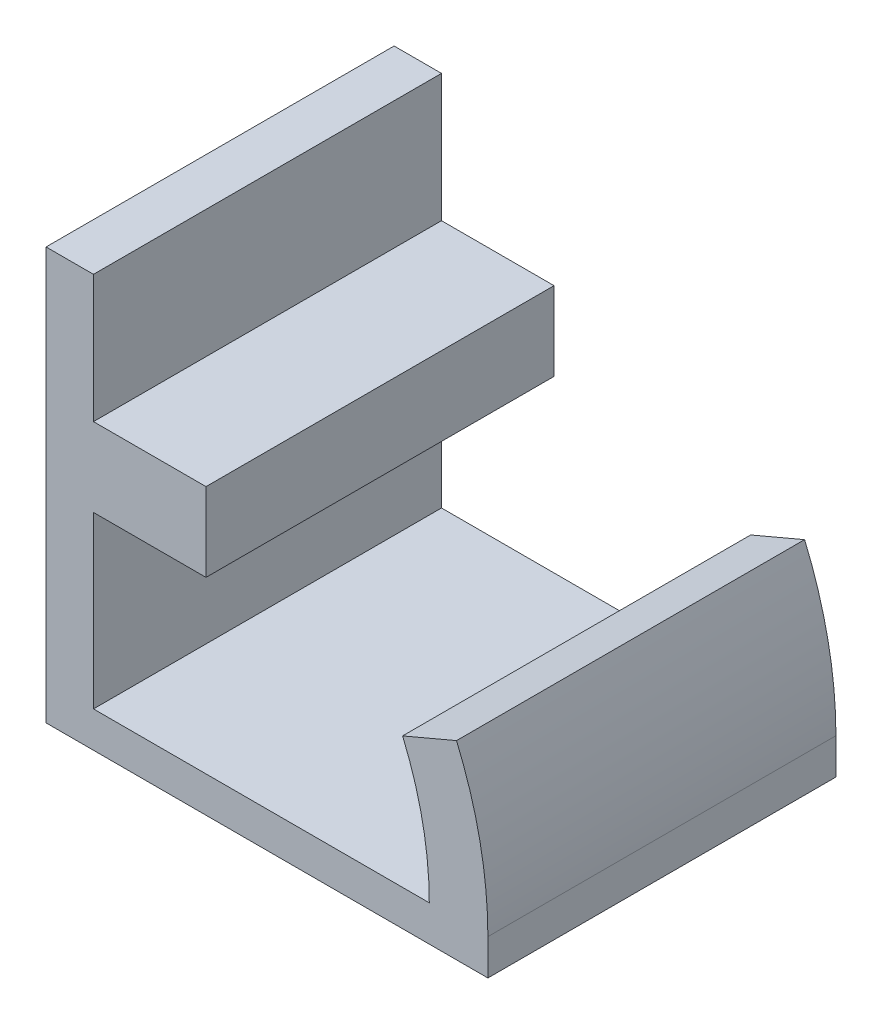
ISO-10303-21;
HEADER;
FILE_DESCRIPTION(('STEP AP214'),'2;1');
FILE_NAME('part.step','',(''),(''),'','','');
FILE_SCHEMA(('AUTOMOTIVE_DESIGN { 1 0 10303 214 1 1 1 1 }'));
ENDSEC;
DATA;
#1=APPLICATION_CONTEXT('core data for automotive mechanical design processes');
#2=APPLICATION_PROTOCOL_DEFINITION('international standard','automotive_design',2000,#1);
#3=PRODUCT_CONTEXT('',#1,'mechanical');
#4=PRODUCT('Part','Part','',(#3));
#5=PRODUCT_RELATED_PRODUCT_CATEGORY('part','',(#4));
#6=PRODUCT_DEFINITION_FORMATION('','',#4);
#7=PRODUCT_DEFINITION_CONTEXT('part definition',#1,'design');
#8=PRODUCT_DEFINITION('design','',#6,#7);
#9=PRODUCT_DEFINITION_SHAPE('','',#8);
#10=(LENGTH_UNIT() NAMED_UNIT(*) SI_UNIT(.MILLI.,.METRE.));
#11=(NAMED_UNIT(*) PLANE_ANGLE_UNIT() SI_UNIT($,.RADIAN.));
#12=(NAMED_UNIT(*) SI_UNIT($,.STERADIAN.) SOLID_ANGLE_UNIT());
#13=UNCERTAINTY_MEASURE_WITH_UNIT(LENGTH_MEASURE(1.E-05),#10,'distance_accuracy_value','');
#14=(GEOMETRIC_REPRESENTATION_CONTEXT(3) GLOBAL_UNCERTAINTY_ASSIGNED_CONTEXT((#13)) GLOBAL_UNIT_ASSIGNED_CONTEXT((#10,
#11,#12)) REPRESENTATION_CONTEXT('',''));
#15=CARTESIAN_POINT('',(0.,0.,0.));
#16=DIRECTION('',(0.,0.,1.));
#17=DIRECTION('',(1.,0.,0.));
#18=AXIS2_PLACEMENT_3D('',#15,#16,#17);
#19=CARTESIAN_POINT('',(18.1175022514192,13.684496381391,66.5));
#20=DIRECTION('',(-1.,0.,0.));
#21=DIRECTION('',(0.,0.,1.));
#22=AXIS2_PLACEMENT_3D('',#19,#20,#21);
#23=PLANE('',#22);
#24=DIRECTION('',(0.,0.,-1.));
#25=VECTOR('',#24,1.);
#26=CARTESIAN_POINT('',(18.1175022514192,78.7188677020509,66.5));
#27=LINE('',#26,#25);
#28=CARTESIAN_POINT('',(18.1175022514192,78.7188677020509,66.5));
#29=VERTEX_POINT('',#28);
#30=CARTESIAN_POINT('',(18.1175022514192,78.7188677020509,-66.5));
#31=VERTEX_POINT('',#30);
#32=EDGE_CURVE('E167',#29,#31,#27,.T.);
#33=ORIENTED_EDGE('',*,*,#32,.F.);
#34=DIRECTION('',(0.,1.,0.));
#35=VECTOR('',#34,1.);
#36=CARTESIAN_POINT('',(18.1175022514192,13.684496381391,66.5));
#37=LINE('',#36,#35);
#38=CARTESIAN_POINT('',(18.1175022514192,13.684496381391,66.5));
#39=VERTEX_POINT('',#38);
#40=EDGE_CURVE('E203',#39,#29,#37,.T.);
#41=ORIENTED_EDGE('',*,*,#40,.F.);
#42=DIRECTION('',(0.,0.,-1.));
#43=VECTOR('',#42,1.);
#44=CARTESIAN_POINT('',(18.1175022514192,13.684496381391,66.5));
#45=LINE('',#44,#43);
#46=CARTESIAN_POINT('',(18.1175022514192,13.684496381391,-66.5));
#47=VERTEX_POINT('',#46);
#48=EDGE_CURVE('E217',#39,#47,#45,.T.);
#49=ORIENTED_EDGE('',*,*,#48,.T.);
#50=DIRECTION('',(0.,1.,0.));
#51=VECTOR('',#50,1.);
#52=CARTESIAN_POINT('',(18.1175022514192,13.684496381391,-66.5));
#53=LINE('',#52,#51);
#54=EDGE_CURVE('E139',#47,#31,#53,.T.);
#55=ORIENTED_EDGE('',*,*,#54,.T.);
#56=EDGE_LOOP('',(#33,#41,#49,#55));
#57=FACE_BOUND('',#56,.T.);
#58=ADVANCED_FACE('F35',(#57),#23,.F.);
#59=DIRECTION('',(0.,0.,1.));
#60=VECTOR('',#59,1.);
#61=CARTESIAN_POINT('',(18.1175022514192,108.761947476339,66.5));
#62=LINE('',#61,#60);
#63=CARTESIAN_POINT('',(18.1175022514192,108.761947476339,-66.5));
#64=VERTEX_POINT('',#63);
#65=CARTESIAN_POINT('',(18.1175022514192,108.761947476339,66.5));
#66=VERTEX_POINT('',#65);
#67=EDGE_CURVE('E172',#64,#66,#62,.T.);
#68=ORIENTED_EDGE('',*,*,#67,.F.);
#69=CARTESIAN_POINT('',(18.1175022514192,157.514311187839,-66.5));
#70=VERTEX_POINT('',#69);
#71=EDGE_CURVE('E141',#64,#70,#53,.T.);
#72=ORIENTED_EDGE('',*,*,#71,.T.);
#73=DIRECTION('',(0.,0.,-1.));
#74=VECTOR('',#73,1.);
#75=CARTESIAN_POINT('',(18.1175022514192,157.514311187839,66.5));
#76=LINE('',#75,#74);
#77=CARTESIAN_POINT('',(18.1175022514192,157.514311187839,66.5));
#78=VERTEX_POINT('',#77);
#79=EDGE_CURVE('E206',#78,#70,#76,.T.);
#80=ORIENTED_EDGE('',*,*,#79,.F.);
#81=EDGE_CURVE('E58',#66,#78,#37,.T.);
#82=ORIENTED_EDGE('',*,*,#81,.F.);
#83=EDGE_LOOP('',(#68,#72,#80,#82));
#84=FACE_BOUND('',#83,.T.);
#85=ADVANCED_FACE('F248',(#84),#23,.F.);
#86=CARTESIAN_POINT('',(18.1175022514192,157.514311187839,66.5));
#87=DIRECTION('',(0.,-1.,0.));
#88=DIRECTION('',(0.,0.,-1.));
#89=AXIS2_PLACEMENT_3D('',#86,#87,#88);
#90=PLANE('',#89);
#91=DIRECTION('',(-1.,0.,0.));
#92=VECTOR('',#91,1.);
#93=CARTESIAN_POINT('',(18.1175022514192,157.514311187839,-66.5));
#94=LINE('',#93,#92);
#95=CARTESIAN_POINT('',(0.,157.514311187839,-66.5));
#96=VERTEX_POINT('',#95);
#97=EDGE_CURVE('E192',#70,#96,#94,.T.);
#98=ORIENTED_EDGE('',*,*,#97,.T.);
#99=DIRECTION('',(0.,0.,-1.));
#100=VECTOR('',#99,1.);
#101=CARTESIAN_POINT('',(0.,157.514311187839,66.5));
#102=LINE('',#101,#100);
#103=CARTESIAN_POINT('',(0.,157.514311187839,66.5));
#104=VERTEX_POINT('',#103);
#105=EDGE_CURVE('E11',#104,#96,#102,.T.);
#106=ORIENTED_EDGE('',*,*,#105,.F.);
#107=DIRECTION('',(-1.,0.,0.));
#108=VECTOR('',#107,1.);
#109=CARTESIAN_POINT('',(18.1175022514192,157.514311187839,66.5));
#110=LINE('',#109,#108);
#111=EDGE_CURVE('E193',#78,#104,#110,.T.);
#112=ORIENTED_EDGE('',*,*,#111,.F.);
#113=ORIENTED_EDGE('',*,*,#79,.T.);
#114=EDGE_LOOP('',(#98,#106,#112,#113));
#115=FACE_BOUND('',#114,.T.);
#116=ADVANCED_FACE('F37',(#115),#90,.F.);
#117=CARTESIAN_POINT('',(0.,157.514311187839,66.5));
#118=DIRECTION('',(1.,0.,0.));
#119=DIRECTION('',(0.,0.,-1.));
#120=AXIS2_PLACEMENT_3D('',#117,#118,#119);
#121=PLANE('',#120);
#122=DIRECTION('',(0.,-1.,0.));
#123=VECTOR('',#122,1.);
#124=CARTESIAN_POINT('',(0.,157.514311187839,-66.5));
#125=LINE('',#124,#123);
#126=CARTESIAN_POINT('',(0.,0.,-66.5));
#127=VERTEX_POINT('',#126);
#128=EDGE_CURVE('E209',#96,#127,#125,.T.);
#129=ORIENTED_EDGE('',*,*,#128,.T.);
#130=DIRECTION('',(0.,0.,-1.));
#131=VECTOR('',#130,1.);
#132=CARTESIAN_POINT('',(0.,0.,66.5));
#133=LINE('',#132,#131);
#134=CARTESIAN_POINT('',(0.,0.,66.5));
#135=VERTEX_POINT('',#134);
#136=EDGE_CURVE('E43',#135,#127,#133,.T.);
#137=ORIENTED_EDGE('',*,*,#136,.F.);
#138=DIRECTION('',(0.,-1.,0.));
#139=VECTOR('',#138,1.);
#140=CARTESIAN_POINT('',(0.,157.514311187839,66.5));
#141=LINE('',#140,#139);
#142=EDGE_CURVE('E196',#104,#135,#141,.T.);
#143=ORIENTED_EDGE('',*,*,#142,.F.);
#144=ORIENTED_EDGE('',*,*,#105,.T.);
#145=EDGE_LOOP('',(#129,#137,#143,#144));
#146=FACE_BOUND('',#145,.T.);
#147=ADVANCED_FACE('F243',(#146),#121,.F.);
#148=CARTESIAN_POINT('',(0.,0.,66.5));
#149=DIRECTION('',(0.,1.,0.));
#150=DIRECTION('',(0.,0.,1.));
#151=AXIS2_PLACEMENT_3D('',#148,#149,#150);
#152=PLANE('',#151);
#153=DIRECTION('',(1.,0.,0.));
#154=VECTOR('',#153,1.);
#155=CARTESIAN_POINT('',(0.,0.,-66.5));
#156=LINE('',#155,#154);
#157=CARTESIAN_POINT('',(168.839701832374,0.,-66.5));
#158=VERTEX_POINT('',#157);
#159=EDGE_CURVE('E211',#127,#158,#156,.T.);
#160=ORIENTED_EDGE('',*,*,#159,.T.);
#161=DIRECTION('',(0.,0.,-1.));
#162=VECTOR('',#161,1.);
#163=CARTESIAN_POINT('',(168.839701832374,0.,66.5));
#164=LINE('',#163,#162);
#165=CARTESIAN_POINT('',(168.839701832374,0.,66.5));
#166=VERTEX_POINT('',#165);
#167=EDGE_CURVE('E222',#166,#158,#164,.T.);
#168=ORIENTED_EDGE('',*,*,#167,.F.);
#169=DIRECTION('',(1.,0.,0.));
#170=VECTOR('',#169,1.);
#171=CARTESIAN_POINT('',(0.,0.,66.5));
#172=LINE('',#171,#170);
#173=EDGE_CURVE('E198',#135,#166,#172,.T.);
#174=ORIENTED_EDGE('',*,*,#173,.F.);
#175=ORIENTED_EDGE('',*,*,#136,.T.);
#176=EDGE_LOOP('',(#160,#168,#174,#175));
#177=FACE_BOUND('',#176,.T.);
#178=ADVANCED_FACE('F229',(#177),#152,.F.);
#179=CARTESIAN_POINT('',(168.839701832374,0.,66.5));
#180=DIRECTION('',(-1.,0.,0.));
#181=DIRECTION('',(0.,0.,1.));
#182=AXIS2_PLACEMENT_3D('',#179,#180,#181);
#183=PLANE('',#182);
#184=DIRECTION('',(0.,1.,0.));
#185=VECTOR('',#184,1.);
#186=CARTESIAN_POINT('',(168.839701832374,0.,-66.5));
#187=LINE('',#186,#185);
#188=CARTESIAN_POINT('',(168.839701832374,13.684496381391,-66.5));
#189=VERTEX_POINT('',#188);
#190=EDGE_CURVE('E142',#158,#189,#187,.T.);
#191=ORIENTED_EDGE('',*,*,#190,.T.);
#192=DIRECTION('',(0.,0.,-1.));
#193=VECTOR('',#192,1.);
#194=CARTESIAN_POINT('',(168.839701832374,13.684496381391,66.5));
#195=LINE('',#194,#193);
#196=CARTESIAN_POINT('',(168.839701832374,13.684496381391,66.5));
#197=VERTEX_POINT('',#196);
#198=EDGE_CURVE('E219',#197,#189,#195,.T.);
#199=ORIENTED_EDGE('',*,*,#198,.F.);
#200=DIRECTION('',(0.,1.,0.));
#201=VECTOR('',#200,1.);
#202=CARTESIAN_POINT('',(168.839701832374,0.,66.5));
#203=LINE('',#202,#201);
#204=EDGE_CURVE('E200',#166,#197,#203,.T.);
#205=ORIENTED_EDGE('',*,*,#204,.F.);
#206=ORIENTED_EDGE('',*,*,#167,.T.);
#207=EDGE_LOOP('',(#191,#199,#205,#206));
#208=FACE_BOUND('',#207,.T.);
#209=ADVANCED_FACE('F235',(#208),#183,.F.);
#210=CARTESIAN_POINT('',(168.839701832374,13.684496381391,66.5));
#211=DIRECTION('',(0.,-1.,0.));
#212=DIRECTION('',(0.,0.,-1.));
#213=AXIS2_PLACEMENT_3D('',#210,#211,#212);
#214=PLANE('',#213);
#215=DIRECTION('',(-1.,0.,0.));
#216=VECTOR('',#215,1.);
#217=CARTESIAN_POINT('',(168.839701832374,13.684496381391,66.5));
#218=LINE('',#217,#216);
#219=CARTESIAN_POINT('',(146.4481546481,13.684496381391,66.5));
#220=VERTEX_POINT('',#219);
#221=EDGE_CURVE('E50',#220,#39,#218,.T.);
#222=ORIENTED_EDGE('',*,*,#221,.F.);
#223=DIRECTION('',(0.,0.,-1.));
#224=VECTOR('',#223,1.);
#225=CARTESIAN_POINT('',(146.4481546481,13.684496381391,0.0526826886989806));
#226=LINE('',#225,#224);
#227=CARTESIAN_POINT('',(146.4481546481,13.684496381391,-66.5));
#228=VERTEX_POINT('',#227);
#229=EDGE_CURVE('E145',#220,#228,#226,.T.);
#230=ORIENTED_EDGE('',*,*,#229,.T.);
#231=DIRECTION('',(-1.,0.,0.));
#232=VECTOR('',#231,1.);
#233=CARTESIAN_POINT('',(168.839701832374,13.684496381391,-66.5));
#234=LINE('',#233,#232);
#235=EDGE_CURVE('E131',#228,#47,#234,.T.);
#236=ORIENTED_EDGE('',*,*,#235,.T.);
#237=ORIENTED_EDGE('',*,*,#48,.F.);
#238=EDGE_LOOP('',(#222,#230,#236,#237));
#239=FACE_BOUND('',#238,.T.);
#240=ADVANCED_FACE('F146',(#239),#214,.F.);
#241=CARTESIAN_POINT('',(0.,157.514311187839,66.5));
#242=DIRECTION('',(0.,0.,1.));
#243=DIRECTION('',(1.,0.,0.));
#244=AXIS2_PLACEMENT_3D('',#241,#242,#243);
#245=PLANE('',#244);
#246=ORIENTED_EDGE('',*,*,#111,.T.);
#247=ORIENTED_EDGE('',*,*,#142,.T.);
#248=ORIENTED_EDGE('',*,*,#173,.T.);
#249=ORIENTED_EDGE('',*,*,#204,.T.);
#250=CARTESIAN_POINT('',(18.1175022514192,13.684496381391,66.5));
#251=DIRECTION('',(0.,0.,-1.));
#252=DIRECTION('',(-1.,0.,0.));
#253=AXIS2_PLACEMENT_3D('',#250,#251,#252);
#254=CIRCLE('',#253,150.722199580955);
#255=CARTESIAN_POINT('',(156.858018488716,72.5763515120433,66.5));
#256=VERTEX_POINT('',#255);
#257=EDGE_CURVE('E157',#256,#197,#254,.T.);
#258=ORIENTED_EDGE('',*,*,#257,.F.);
#259=DIRECTION('',(0.92050485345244,0.390731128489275,0.));
#260=VECTOR('',#259,1.);
#261=CARTESIAN_POINT('',(-64.066033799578,-21.2003449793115,66.5));
#262=LINE('',#261,#260);
#263=CARTESIAN_POINT('',(136.246490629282,63.827277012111,66.5));
#264=VERTEX_POINT('',#263);
#265=EDGE_CURVE('E261',#264,#256,#262,.T.);
#266=ORIENTED_EDGE('',*,*,#265,.F.);
#267=CARTESIAN_POINT('',(18.1175022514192,13.684496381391,66.5));
#268=DIRECTION('',(0.,0.,-1.));
#269=DIRECTION('',(-1.,0.,0.));
#270=AXIS2_PLACEMENT_3D('',#267,#268,#269);
#271=CIRCLE('',#270,128.330652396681);
#272=EDGE_CURVE('E165',#264,#220,#271,.T.);
#273=ORIENTED_EDGE('',*,*,#272,.T.);
#274=ORIENTED_EDGE('',*,*,#221,.T.);
#275=ORIENTED_EDGE('',*,*,#40,.T.);
#276=DIRECTION('',(-1.,0.,0.));
#277=VECTOR('',#276,1.);
#278=CARTESIAN_POINT('',(61.1175022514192,78.7188677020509,66.5));
#279=LINE('',#278,#277);
#280=CARTESIAN_POINT('',(61.1175022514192,78.7188677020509,66.5));
#281=VERTEX_POINT('',#280);
#282=EDGE_CURVE('E189',#281,#29,#279,.T.);
#283=ORIENTED_EDGE('',*,*,#282,.F.);
#284=DIRECTION('',(0.,-1.,0.));
#285=VECTOR('',#284,1.);
#286=CARTESIAN_POINT('',(61.1175022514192,108.761947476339,66.5));
#287=LINE('',#286,#285);
#288=CARTESIAN_POINT('',(61.1175022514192,108.761947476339,66.5));
#289=VERTEX_POINT('',#288);
#290=EDGE_CURVE('E168',#289,#281,#287,.T.);
#291=ORIENTED_EDGE('',*,*,#290,.F.);
#292=DIRECTION('',(-1.,0.,0.));
#293=VECTOR('',#292,1.);
#294=CARTESIAN_POINT('',(61.1175022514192,108.761947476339,66.5));
#295=LINE('',#294,#293);
#296=EDGE_CURVE('E178',#289,#66,#295,.T.);
#297=ORIENTED_EDGE('',*,*,#296,.T.);
#298=ORIENTED_EDGE('',*,*,#81,.T.);
#299=EDGE_LOOP('',(#246,#247,#248,#249,#258,#266,#273,#274,#275,#283,#291,#297,#298));
#300=FACE_BOUND('',#299,.T.);
#301=ADVANCED_FACE('F238',(#300),#245,.T.);
#302=CARTESIAN_POINT('',(0.,157.514311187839,-66.5));
#303=DIRECTION('',(0.,0.,1.));
#304=DIRECTION('',(1.,0.,0.));
#305=AXIS2_PLACEMENT_3D('',#302,#303,#304);
#306=PLANE('',#305);
#307=ORIENTED_EDGE('',*,*,#97,.F.);
#308=ORIENTED_EDGE('',*,*,#71,.F.);
#309=DIRECTION('',(-1.,0.,0.));
#310=VECTOR('',#309,1.);
#311=CARTESIAN_POINT('',(61.1175022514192,108.761947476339,-66.5));
#312=LINE('',#311,#310);
#313=CARTESIAN_POINT('',(61.1175022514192,108.761947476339,-66.5));
#314=VERTEX_POINT('',#313);
#315=EDGE_CURVE('E184',#314,#64,#312,.T.);
#316=ORIENTED_EDGE('',*,*,#315,.F.);
#317=DIRECTION('',(0.,1.,0.));
#318=VECTOR('',#317,1.);
#319=CARTESIAN_POINT('',(61.1175022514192,108.761947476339,-66.5));
#320=LINE('',#319,#318);
#321=CARTESIAN_POINT('',(61.1175022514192,78.7188677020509,-66.5));
#322=VERTEX_POINT('',#321);
#323=EDGE_CURVE('E174',#322,#314,#320,.T.);
#324=ORIENTED_EDGE('',*,*,#323,.F.);
#325=DIRECTION('',(-1.,0.,0.));
#326=VECTOR('',#325,1.);
#327=CARTESIAN_POINT('',(61.1175022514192,78.7188677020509,-66.5));
#328=LINE('',#327,#326);
#329=EDGE_CURVE('E187',#322,#31,#328,.T.);
#330=ORIENTED_EDGE('',*,*,#329,.T.);
#331=ORIENTED_EDGE('',*,*,#54,.F.);
#332=ORIENTED_EDGE('',*,*,#235,.F.);
#333=CARTESIAN_POINT('',(18.1175022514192,13.684496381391,-66.5));
#334=DIRECTION('',(0.,0.,-1.));
#335=DIRECTION('',(-1.,0.,0.));
#336=AXIS2_PLACEMENT_3D('',#333,#334,#335);
#337=CIRCLE('',#336,128.330652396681);
#338=CARTESIAN_POINT('',(136.246490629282,63.827277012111,-66.5));
#339=VERTEX_POINT('',#338);
#340=EDGE_CURVE('E136',#339,#228,#337,.T.);
#341=ORIENTED_EDGE('',*,*,#340,.F.);
#342=DIRECTION('',(-0.92050485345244,-0.390731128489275,0.));
#343=VECTOR('',#342,1.);
#344=CARTESIAN_POINT('',(-64.066033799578,-21.2003449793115,-66.5));
#345=LINE('',#344,#343);
#346=CARTESIAN_POINT('',(156.858018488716,72.5763515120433,-66.5));
#347=VERTEX_POINT('',#346);
#348=EDGE_CURVE('E154',#347,#339,#345,.T.);
#349=ORIENTED_EDGE('',*,*,#348,.F.);
#350=CARTESIAN_POINT('',(18.1175022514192,13.684496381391,-66.5));
#351=DIRECTION('',(0.,0.,-1.));
#352=DIRECTION('',(-1.,0.,0.));
#353=AXIS2_PLACEMENT_3D('',#350,#351,#352);
#354=CIRCLE('',#353,150.722199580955);
#355=EDGE_CURVE('E153',#347,#189,#354,.T.);
#356=ORIENTED_EDGE('',*,*,#355,.T.);
#357=ORIENTED_EDGE('',*,*,#190,.F.);
#358=ORIENTED_EDGE('',*,*,#159,.F.);
#359=ORIENTED_EDGE('',*,*,#128,.F.);
#360=EDGE_LOOP('',(#307,#308,#316,#324,#330,#331,#332,#341,#349,#356,#357,#358,#359));
#361=FACE_BOUND('',#360,.T.);
#362=ADVANCED_FACE('F133',(#361),#306,.F.);
#363=CARTESIAN_POINT('',(61.1175022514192,78.7188677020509,66.5));
#364=DIRECTION('',(0.,1.,0.));
#365=DIRECTION('',(0.,0.,1.));
#366=AXIS2_PLACEMENT_3D('',#363,#364,#365);
#367=PLANE('',#366);
#368=ORIENTED_EDGE('',*,*,#32,.T.);
#369=ORIENTED_EDGE('',*,*,#329,.F.);
#370=DIRECTION('',(0.,0.,-1.));
#371=VECTOR('',#370,1.);
#372=CARTESIAN_POINT('',(61.1175022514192,78.7188677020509,66.5));
#373=LINE('',#372,#371);
#374=EDGE_CURVE('E171',#281,#322,#373,.T.);
#375=ORIENTED_EDGE('',*,*,#374,.F.);
#376=ORIENTED_EDGE('',*,*,#282,.T.);
#377=EDGE_LOOP('',(#368,#369,#375,#376));
#378=FACE_BOUND('',#377,.T.);
#379=ADVANCED_FACE('F258',(#378),#367,.F.);
#380=CARTESIAN_POINT('',(61.1175022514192,108.761947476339,66.5));
#381=DIRECTION('',(0.,-1.,0.));
#382=DIRECTION('',(0.,0.,-1.));
#383=AXIS2_PLACEMENT_3D('',#380,#381,#382);
#384=PLANE('',#383);
#385=ORIENTED_EDGE('',*,*,#67,.T.);
#386=ORIENTED_EDGE('',*,*,#296,.F.);
#387=DIRECTION('',(0.,0.,1.));
#388=VECTOR('',#387,1.);
#389=CARTESIAN_POINT('',(61.1175022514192,108.761947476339,66.5));
#390=LINE('',#389,#388);
#391=EDGE_CURVE('E176',#314,#289,#390,.T.);
#392=ORIENTED_EDGE('',*,*,#391,.F.);
#393=ORIENTED_EDGE('',*,*,#315,.T.);
#394=EDGE_LOOP('',(#385,#386,#392,#393));
#395=FACE_BOUND('',#394,.T.);
#396=ADVANCED_FACE('F251',(#395),#384,.F.);
#397=CARTESIAN_POINT('',(61.1175022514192,78.7188677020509,66.5));
#398=DIRECTION('',(1.,0.,0.));
#399=DIRECTION('',(0.,0.,-1.));
#400=AXIS2_PLACEMENT_3D('',#397,#398,#399);
#401=PLANE('',#400);
#402=ORIENTED_EDGE('',*,*,#290,.T.);
#403=ORIENTED_EDGE('',*,*,#374,.T.);
#404=ORIENTED_EDGE('',*,*,#323,.T.);
#405=ORIENTED_EDGE('',*,*,#391,.T.);
#406=EDGE_LOOP('',(#402,#403,#404,#405));
#407=FACE_BOUND('',#406,.T.);
#408=ADVANCED_FACE('F254',(#407),#401,.T.);
#409=CARTESIAN_POINT('',(18.1175022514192,13.684496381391,66.5));
#410=DIRECTION('',(0.,0.,-1.));
#411=DIRECTION('',(-1.,0.,0.));
#412=AXIS2_PLACEMENT_3D('',#409,#410,#411);
#413=CYLINDRICAL_SURFACE('',#412,128.330652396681);
#414=ORIENTED_EDGE('',*,*,#272,.F.);
#415=DIRECTION('',(0.,0.,-1.));
#416=VECTOR('',#415,1.);
#417=CARTESIAN_POINT('',(136.246490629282,63.827277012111,0.0526826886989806));
#418=LINE('',#417,#416);
#419=EDGE_CURVE('E148',#264,#339,#418,.T.);
#420=ORIENTED_EDGE('',*,*,#419,.T.);
#421=ORIENTED_EDGE('',*,*,#340,.T.);
#422=ORIENTED_EDGE('',*,*,#229,.F.);
#423=EDGE_LOOP('',(#414,#420,#421,#422));
#424=FACE_BOUND('',#423,.T.);
#425=ADVANCED_FACE('F150',(#424),#413,.F.);
#426=CARTESIAN_POINT('',(18.1175022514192,13.684496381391,66.5));
#427=DIRECTION('',(0.,0.,-1.));
#428=DIRECTION('',(-1.,0.,0.));
#429=AXIS2_PLACEMENT_3D('',#426,#427,#428);
#430=CYLINDRICAL_SURFACE('',#429,150.722199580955);
#431=ORIENTED_EDGE('',*,*,#355,.F.);
#432=DIRECTION('',(0.,0.,-1.));
#433=VECTOR('',#432,1.);
#434=CARTESIAN_POINT('',(156.858018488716,72.5763515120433,0.0526826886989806));
#435=LINE('',#434,#433);
#436=EDGE_CURVE('E159',#256,#347,#435,.T.);
#437=ORIENTED_EDGE('',*,*,#436,.F.);
#438=ORIENTED_EDGE('',*,*,#257,.T.);
#439=ORIENTED_EDGE('',*,*,#198,.T.);
#440=EDGE_LOOP('',(#431,#437,#438,#439));
#441=FACE_BOUND('',#440,.T.);
#442=ADVANCED_FACE('F269',(#441),#430,.T.);
#443=CARTESIAN_POINT('',(-64.066033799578,-21.2003449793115,0.0526826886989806));
#444=DIRECTION('',(-0.390731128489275,0.92050485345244,0.));
#445=DIRECTION('',(0.,0.,1.));
#446=AXIS2_PLACEMENT_3D('',#443,#444,#445);
#447=PLANE('',#446);
#448=ORIENTED_EDGE('',*,*,#419,.F.);
#449=ORIENTED_EDGE('',*,*,#265,.T.);
#450=ORIENTED_EDGE('',*,*,#436,.T.);
#451=ORIENTED_EDGE('',*,*,#348,.T.);
#452=EDGE_LOOP('',(#448,#449,#450,#451));
#453=FACE_BOUND('',#452,.T.);
#454=ADVANCED_FACE('F263',(#453),#447,.T.);
#455=CLOSED_SHELL('',(#58,#85,#116,#147,#178,#209,#240,#301,#362,#379,#396,#408,#425,#442,#454));
#456=MANIFOLD_SOLID_BREP('B2',#455);
#457=ADVANCED_BREP_SHAPE_REPRESENTATION('',(#18,#456),#14);
#458=SHAPE_DEFINITION_REPRESENTATION(#9,#457);
ENDSEC;
END-ISO-10303-21;
